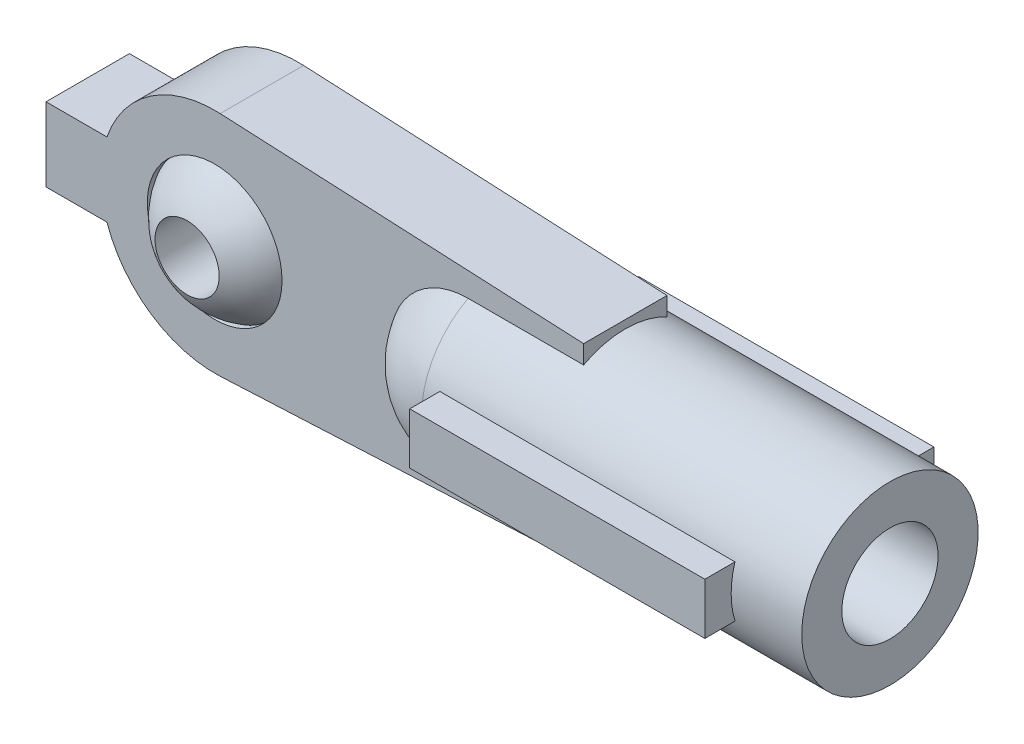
from build123d import *

# Parameters (mm, degrees)
ESQUISSE1_R                  = 2.1
BOSS_EXTRU_1_DEPTH           = 1.3
ESQUISSE3_R                  = 1.5
ENL_V_MAT_EXTRU_1_DEPTH      = 11.5
ENL_V_MAT_EXTRU_2_DEPTH      = 21.254073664
ENL_V_MAT_EXTRU_2_DEPTH_BACK = 21.254073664
ESQUISSE5_W                  = 6
ESQUISSE5_H                  = 1
ESQUISSE6_R                  = 1
ENL_V_MAT_EXTRU_3_DEPTH      = 21.665638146
BOSS_EXTRU_2_DEPTH           = 9.2


with BuildPart() as part:
    # Esquisse1 → Boss.-Extru.1 (new, symmetric)
    with BuildSketch(Plane.XY):
        with BuildLine():
            Line((11.5, -3), (11.5, 3))
            Line((11.5, 3), (0.170855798, 3.545886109))
            ThreePointArc((0.170855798, 3.545886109), (-1.993853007, 2.937184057), (-3.358571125, 1.15))
            Line((-3.358571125, 1.15), (-5.258571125, 1.15))
            Line((-5.258571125, 1.15), (-5.258571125, -1.15))
            Line((-5.258571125, -1.15), (-3.358571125, -1.15))
            ThreePointArc((-3.358571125, -1.15), (-1.993853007, -2.937184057), (0.170855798, -3.545886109))
            Line((0.170855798, -3.545886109), (11.5, -3))
        make_face()
        Circle(ESQUISSE1_R, mode=Mode.SUBTRACT)
    extrude(amount=BOSS_EXTRU_1_DEPTH, both=True)

    # Esquisse2 → R_volution1 (revolve)
    with BuildSketch(Plane.XY, mode=Mode.PRIVATE) as r_volution1_sk:
        with BuildLine():
            Line((7.9, 2.75), (19.75, 2.75))
            Line((19.75, 2.75), (19.75, 0))
            Line((19.75, 0), (5.15, 0))
            ThreePointArc((5.15, 0), (5.955456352, 1.944543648), (7.9, 2.75))
        make_face()
    revolve(r_volution1_sk.sketch.rotate(Axis((0, 0, 0), (1, 0, 0)), 90), axis=Axis((0, 0, 0), (1, 0, 0)))

    # Esquisse3 → Enl_v. mat.-Extru.1 (cut)
    with BuildSketch(Plane(origin=(19.75, 0, 0), x_dir=(0, 0, -1), z_dir=(1, 0, 0))):
        Circle(ESQUISSE3_R)
    extrude(amount=-ENL_V_MAT_EXTRU_1_DEPTH, mode=Mode.SUBTRACT)

    # Esquisse7 → Boss.-Extru.2 (add)
    with BuildSketch(Plane(origin=(17.55, 0, 0), x_dir=(0, 0, -1), z_dir=(1, 0, 0))):
        with BuildLine():
            Line((2.631064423, -0.8), (3.57, -0.8))
            Line((3.57, -0.8), (3.57, 0.8))
            Line((3.57, 0.8), (2.631064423, 0.8))
            ThreePointArc((2.631064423, 0.8), (2.75, 0), (2.631064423, -0.8))
        make_face()
        with BuildLine():
            Line((-3.57, 0.8), (-2.631064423, 0.8))
            ThreePointArc((-2.631064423, 0.8), (-2.75, 0), (-2.631064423, -0.8))
            Line((-2.631064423, -0.8), (-3.57, -0.8))
            Line((-3.57, -0.8), (-3.57, 0.8))
        make_face()
    extrude(amount=-BOSS_EXTRU_2_DEPTH)


with BuildPart() as body_2:
    # Esquisse4 → R_volution2 (revolve)
    with BuildSketch(Plane.XY):
        with BuildLine():
            Line((0, 2.38), (0, -2.38))
            ThreePointArc((0, -2.38), (2.38, 0), (0, 2.38))
        make_face()
    revolve(axis=Axis((0, 0, 0), (0, 1, 0)))

    # Esquisse5 → Enl_v. mat.-Extru.2 (cut, two sides: drawn at the far end of the back side and taken through both)
    with BuildSketch(Plane(origin=(0, 0, 0), x_dir=(1, 0, 0), z_dir=(0, 1, 0)).offset(-ENL_V_MAT_EXTRU_2_DEPTH_BACK)):
        with Locations((0, 2.69)):
            Rectangle(ESQUISSE5_W, ESQUISSE5_H)
        with Locations((0, -2.69)):
            Rectangle(ESQUISSE5_W, ESQUISSE5_H)
    extrude(amount=ENL_V_MAT_EXTRU_2_DEPTH + ENL_V_MAT_EXTRU_2_DEPTH_BACK, mode=Mode.SUBTRACT)

    # Esquisse6 → Enl_v. mat.-Extru.3 (cut, through all)
    with BuildSketch(Plane(origin=(0, 0, -2.19), x_dir=(-1, 0, 0), z_dir=(0, 0, -1))):
        with Locations(Location((0, 0, 0), (0, 0, 180))):
            Circle(ESQUISSE6_R)
    extrude(amount=-ENL_V_MAT_EXTRU_3_DEPTH, mode=Mode.SUBTRACT)


solid = Compound([part.part, body_2.part])
